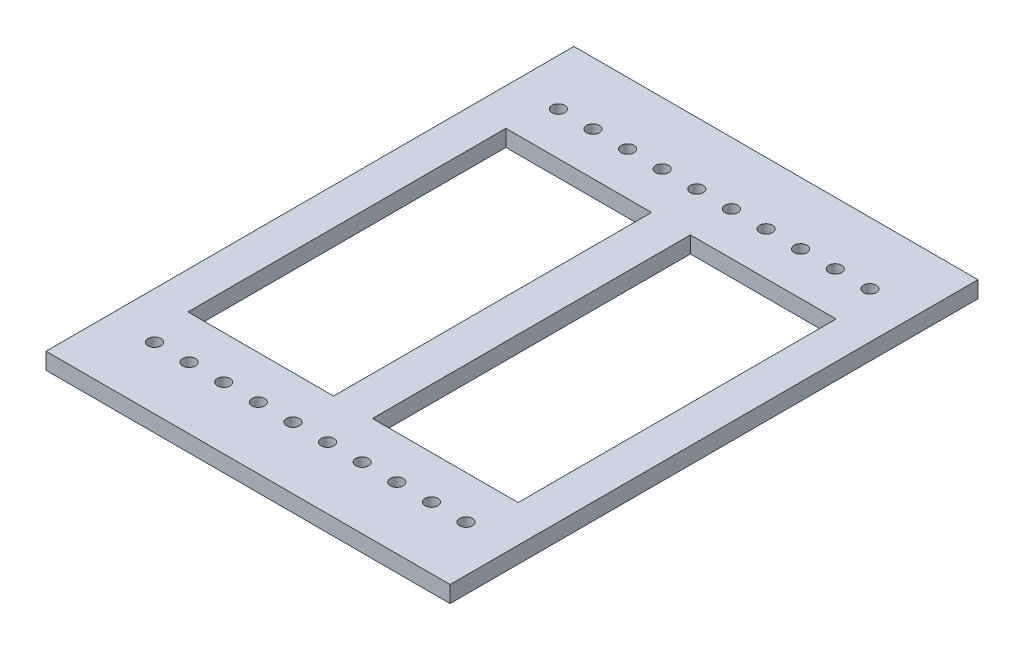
ISO-10303-21;
HEADER;
FILE_DESCRIPTION(('STEP AP214'),'2;1');
FILE_NAME('part.step','',(''),(''),'','','');
FILE_SCHEMA(('AUTOMOTIVE_DESIGN { 1 0 10303 214 1 1 1 1 }'));
ENDSEC;
DATA;
#1=APPLICATION_CONTEXT('core data for automotive mechanical design processes');
#2=APPLICATION_PROTOCOL_DEFINITION('international standard','automotive_design',2000,#1);
#3=PRODUCT_CONTEXT('',#1,'mechanical');
#4=PRODUCT('Part','Part','',(#3));
#5=PRODUCT_RELATED_PRODUCT_CATEGORY('part','',(#4));
#6=PRODUCT_DEFINITION_FORMATION('','',#4);
#7=PRODUCT_DEFINITION_CONTEXT('part definition',#1,'design');
#8=PRODUCT_DEFINITION('design','',#6,#7);
#9=PRODUCT_DEFINITION_SHAPE('','',#8);
#10=(LENGTH_UNIT() NAMED_UNIT(*) SI_UNIT(.MILLI.,.METRE.));
#11=(NAMED_UNIT(*) PLANE_ANGLE_UNIT() SI_UNIT($,.RADIAN.));
#12=(NAMED_UNIT(*) SI_UNIT($,.STERADIAN.) SOLID_ANGLE_UNIT());
#13=UNCERTAINTY_MEASURE_WITH_UNIT(LENGTH_MEASURE(1.E-05),#10,'distance_accuracy_value','');
#14=(GEOMETRIC_REPRESENTATION_CONTEXT(3) GLOBAL_UNCERTAINTY_ASSIGNED_CONTEXT((#13)) GLOBAL_UNIT_ASSIGNED_CONTEXT((#10,
#11,#12)) REPRESENTATION_CONTEXT('',''));
#15=CARTESIAN_POINT('',(0.,0.,0.));
#16=DIRECTION('',(0.,0.,1.));
#17=DIRECTION('',(1.,0.,0.));
#18=AXIS2_PLACEMENT_3D('',#15,#16,#17);
#19=CARTESIAN_POINT('',(0.,0.85,0.));
#20=DIRECTION('',(0.,-1.,0.));
#21=DIRECTION('',(0.,0.,-1.));
#22=AXIS2_PLACEMENT_3D('',#19,#20,#21);
#23=PLANE('',#22);
#24=DIRECTION('',(0.,0.,1.));
#25=VECTOR('',#24,1.);
#26=CARTESIAN_POINT('',(1.9,0.85,-21.75));
#27=LINE('',#26,#25);
#28=CARTESIAN_POINT('',(1.9,0.85,-21.75));
#29=VERTEX_POINT('',#28);
#30=CARTESIAN_POINT('',(1.9,0.85,-5.4));
#31=VERTEX_POINT('',#30);
#32=EDGE_CURVE('E161',#29,#31,#27,.T.);
#33=ORIENTED_EDGE('',*,*,#32,.F.);
#34=DIRECTION('',(-1.,0.,0.));
#35=VECTOR('',#34,1.);
#36=CARTESIAN_POINT('',(1.9,0.85,-21.75));
#37=LINE('',#36,#35);
#38=CARTESIAN_POINT('',(9.39,0.85,-21.75));
#39=VERTEX_POINT('',#38);
#40=EDGE_CURVE('E169',#39,#29,#37,.T.);
#41=ORIENTED_EDGE('',*,*,#40,.F.);
#42=DIRECTION('',(0.,0.,-1.));
#43=VECTOR('',#42,1.);
#44=CARTESIAN_POINT('',(9.39,0.85,-21.75));
#45=LINE('',#44,#43);
#46=CARTESIAN_POINT('',(9.39,0.85,-5.4));
#47=VERTEX_POINT('',#46);
#48=EDGE_CURVE('E166',#47,#39,#45,.T.);
#49=ORIENTED_EDGE('',*,*,#48,.F.);
#50=DIRECTION('',(1.,0.,0.));
#51=VECTOR('',#50,1.);
#52=CARTESIAN_POINT('',(1.9,0.85,-5.4));
#53=LINE('',#52,#51);
#54=EDGE_CURVE('E163',#31,#47,#53,.T.);
#55=ORIENTED_EDGE('',*,*,#54,.F.);
#56=EDGE_LOOP('',(#33,#41,#49,#55));
#57=FACE_BOUND('',#56,.T.);
#58=DIRECTION('',(0.,0.,1.));
#59=VECTOR('',#58,1.);
#60=CARTESIAN_POINT('',(0.,0.85,0.));
#61=LINE('',#60,#59);
#62=CARTESIAN_POINT('',(0.,0.85,-27.15));
#63=VERTEX_POINT('',#62);
#64=CARTESIAN_POINT('',(0.,0.85,0.));
#65=VERTEX_POINT('',#64);
#66=EDGE_CURVE('E192',#63,#65,#61,.T.);
#67=ORIENTED_EDGE('',*,*,#66,.T.);
#68=DIRECTION('',(1.,0.,0.));
#69=VECTOR('',#68,1.);
#70=CARTESIAN_POINT('',(0.,0.85,0.));
#71=LINE('',#70,#69);
#72=CARTESIAN_POINT('',(20.78,0.85,0.));
#73=VERTEX_POINT('',#72);
#74=EDGE_CURVE('E195',#65,#73,#71,.T.);
#75=ORIENTED_EDGE('',*,*,#74,.T.);
#76=DIRECTION('',(0.,0.,-1.));
#77=VECTOR('',#76,1.);
#78=CARTESIAN_POINT('',(20.78,0.85,0.));
#79=LINE('',#78,#77);
#80=CARTESIAN_POINT('',(20.78,0.85,-27.15));
#81=VERTEX_POINT('',#80);
#82=EDGE_CURVE('E198',#73,#81,#79,.T.);
#83=ORIENTED_EDGE('',*,*,#82,.T.);
#84=DIRECTION('',(-1.,0.,0.));
#85=VECTOR('',#84,1.);
#86=CARTESIAN_POINT('',(0.,0.85,-27.15));
#87=LINE('',#86,#85);
#88=EDGE_CURVE('E200',#81,#63,#87,.T.);
#89=ORIENTED_EDGE('',*,*,#88,.T.);
#90=EDGE_LOOP('',(#67,#75,#83,#89));
#91=FACE_BOUND('',#90,.T.);
#92=DIRECTION('',(0.,0.,-1.));
#93=VECTOR('',#92,1.);
#94=CARTESIAN_POINT('',(18.88,0.85,-21.75));
#95=LINE('',#94,#93);
#96=CARTESIAN_POINT('',(18.88,0.85,-5.40000000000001));
#97=VERTEX_POINT('',#96);
#98=CARTESIAN_POINT('',(18.88,0.85,-21.75));
#99=VERTEX_POINT('',#98);
#100=EDGE_CURVE('E122',#97,#99,#95,.T.);
#101=ORIENTED_EDGE('',*,*,#100,.F.);
#102=DIRECTION('',(1.,0.,0.));
#103=VECTOR('',#102,1.);
#104=CARTESIAN_POINT('',(18.88,0.85,-5.40000000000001));
#105=LINE('',#104,#103);
#106=CARTESIAN_POINT('',(11.39,0.85,-5.40000000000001));
#107=VERTEX_POINT('',#106);
#108=EDGE_CURVE('E145',#107,#97,#105,.T.);
#109=ORIENTED_EDGE('',*,*,#108,.F.);
#110=DIRECTION('',(0.,0.,1.));
#111=VECTOR('',#110,1.);
#112=CARTESIAN_POINT('',(11.39,0.85,-21.75));
#113=LINE('',#112,#111);
#114=CARTESIAN_POINT('',(11.39,0.85,-21.75));
#115=VERTEX_POINT('',#114);
#116=EDGE_CURVE('E143',#115,#107,#113,.T.);
#117=ORIENTED_EDGE('',*,*,#116,.F.);
#118=DIRECTION('',(-1.,0.,0.));
#119=VECTOR('',#118,1.);
#120=CARTESIAN_POINT('',(18.88,0.85,-21.75));
#121=LINE('',#120,#119);
#122=EDGE_CURVE('E130',#99,#115,#121,.T.);
#123=ORIENTED_EDGE('',*,*,#122,.F.);
#124=EDGE_LOOP('',(#101,#109,#117,#123));
#125=FACE_BOUND('',#124,.T.);
#126=CARTESIAN_POINT('',(2.389,0.85,-23.96));
#127=DIRECTION('',(0.,1.,0.));
#128=DIRECTION('',(0.,0.,1.));
#129=AXIS2_PLACEMENT_3D('',#126,#127,#128);
#130=CIRCLE('',#129,0.33);
#131=CARTESIAN_POINT('',(2.389,0.85,-23.63));
#132=VERTEX_POINT('',#131);
#133=EDGE_CURVE('E151',#132,#132,#130,.T.);
#134=ORIENTED_EDGE('',*,*,#133,.F.);
#135=EDGE_LOOP('',(#134));
#136=FACE_BOUND('',#135,.T.);
#137=CARTESIAN_POINT('',(18.409,0.85,-3.19));
#138=DIRECTION('',(0.,1.,0.));
#139=DIRECTION('',(0.,0.,-1.));
#140=AXIS2_PLACEMENT_3D('',#137,#138,#139);
#141=CIRCLE('',#140,0.330000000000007);
#142=CARTESIAN_POINT('',(18.409,0.85,-3.52));
#143=VERTEX_POINT('',#142);
#144=EDGE_CURVE('E491',#143,#143,#141,.T.);
#145=ORIENTED_EDGE('',*,*,#144,.F.);
#146=EDGE_LOOP('',(#145));
#147=FACE_BOUND('',#146,.T.);
#148=CARTESIAN_POINT('',(4.169,0.85,-23.96));
#149=DIRECTION('',(0.,1.,0.));
#150=DIRECTION('',(0.,0.,1.));
#151=AXIS2_PLACEMENT_3D('',#148,#149,#150);
#152=CIRCLE('',#151,0.33);
#153=CARTESIAN_POINT('',(4.169,0.85,-23.63));
#154=VERTEX_POINT('',#153);
#155=EDGE_CURVE('E485',#154,#154,#152,.T.);
#156=ORIENTED_EDGE('',*,*,#155,.F.);
#157=EDGE_LOOP('',(#156));
#158=FACE_BOUND('',#157,.T.);
#159=CARTESIAN_POINT('',(5.949,0.85,-23.96));
#160=DIRECTION('',(0.,1.,0.));
#161=DIRECTION('',(0.,0.,1.));
#162=AXIS2_PLACEMENT_3D('',#159,#160,#161);
#163=CIRCLE('',#162,0.33);
#164=CARTESIAN_POINT('',(5.949,0.85,-23.63));
#165=VERTEX_POINT('',#164);
#166=EDGE_CURVE('E479',#165,#165,#163,.T.);
#167=ORIENTED_EDGE('',*,*,#166,.F.);
#168=EDGE_LOOP('',(#167));
#169=FACE_BOUND('',#168,.T.);
#170=CARTESIAN_POINT('',(7.729,0.85,-23.96));
#171=DIRECTION('',(0.,1.,0.));
#172=DIRECTION('',(0.,0.,1.));
#173=AXIS2_PLACEMENT_3D('',#170,#171,#172);
#174=CIRCLE('',#173,0.33);
#175=CARTESIAN_POINT('',(7.729,0.85,-23.63));
#176=VERTEX_POINT('',#175);
#177=EDGE_CURVE('E473',#176,#176,#174,.T.);
#178=ORIENTED_EDGE('',*,*,#177,.F.);
#179=EDGE_LOOP('',(#178));
#180=FACE_BOUND('',#179,.T.);
#181=CARTESIAN_POINT('',(9.509,0.85,-23.96));
#182=DIRECTION('',(0.,1.,0.));
#183=DIRECTION('',(0.,0.,1.));
#184=AXIS2_PLACEMENT_3D('',#181,#182,#183);
#185=CIRCLE('',#184,0.33);
#186=CARTESIAN_POINT('',(9.509,0.85,-23.63));
#187=VERTEX_POINT('',#186);
#188=EDGE_CURVE('E467',#187,#187,#185,.T.);
#189=ORIENTED_EDGE('',*,*,#188,.F.);
#190=EDGE_LOOP('',(#189));
#191=FACE_BOUND('',#190,.T.);
#192=CARTESIAN_POINT('',(11.289,0.85,-23.96));
#193=DIRECTION('',(0.,1.,0.));
#194=DIRECTION('',(0.,0.,1.));
#195=AXIS2_PLACEMENT_3D('',#192,#193,#194);
#196=CIRCLE('',#195,0.329999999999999);
#197=CARTESIAN_POINT('',(11.289,0.85,-23.63));
#198=VERTEX_POINT('',#197);
#199=EDGE_CURVE('E461',#198,#198,#196,.T.);
#200=ORIENTED_EDGE('',*,*,#199,.F.);
#201=EDGE_LOOP('',(#200));
#202=FACE_BOUND('',#201,.T.);
#203=CARTESIAN_POINT('',(13.069,0.85,-23.96));
#204=DIRECTION('',(0.,1.,0.));
#205=DIRECTION('',(0.,0.,1.));
#206=AXIS2_PLACEMENT_3D('',#203,#204,#205);
#207=CIRCLE('',#206,0.329999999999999);
#208=CARTESIAN_POINT('',(13.069,0.85,-23.63));
#209=VERTEX_POINT('',#208);
#210=EDGE_CURVE('E455',#209,#209,#207,.T.);
#211=ORIENTED_EDGE('',*,*,#210,.F.);
#212=EDGE_LOOP('',(#211));
#213=FACE_BOUND('',#212,.T.);
#214=CARTESIAN_POINT('',(14.849,0.85,-23.96));
#215=DIRECTION('',(0.,1.,0.));
#216=DIRECTION('',(0.,0.,1.));
#217=AXIS2_PLACEMENT_3D('',#214,#215,#216);
#218=CIRCLE('',#217,0.329999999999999);
#219=CARTESIAN_POINT('',(14.849,0.85,-23.63));
#220=VERTEX_POINT('',#219);
#221=EDGE_CURVE('E449',#220,#220,#218,.T.);
#222=ORIENTED_EDGE('',*,*,#221,.F.);
#223=EDGE_LOOP('',(#222));
#224=FACE_BOUND('',#223,.T.);
#225=CARTESIAN_POINT('',(16.629,0.85,-23.96));
#226=DIRECTION('',(0.,1.,0.));
#227=DIRECTION('',(0.,0.,1.));
#228=AXIS2_PLACEMENT_3D('',#225,#226,#227);
#229=CIRCLE('',#228,0.33);
#230=CARTESIAN_POINT('',(16.629,0.85,-23.63));
#231=VERTEX_POINT('',#230);
#232=EDGE_CURVE('E443',#231,#231,#229,.T.);
#233=ORIENTED_EDGE('',*,*,#232,.F.);
#234=EDGE_LOOP('',(#233));
#235=FACE_BOUND('',#234,.T.);
#236=CARTESIAN_POINT('',(18.409,0.85,-23.96));
#237=DIRECTION('',(0.,1.,0.));
#238=DIRECTION('',(0.,0.,1.));
#239=AXIS2_PLACEMENT_3D('',#236,#237,#238);
#240=CIRCLE('',#239,0.33);
#241=CARTESIAN_POINT('',(18.409,0.85,-23.63));
#242=VERTEX_POINT('',#241);
#243=EDGE_CURVE('E437',#242,#242,#240,.T.);
#244=ORIENTED_EDGE('',*,*,#243,.F.);
#245=EDGE_LOOP('',(#244));
#246=FACE_BOUND('',#245,.T.);
#247=CARTESIAN_POINT('',(16.629,0.85,-3.19));
#248=DIRECTION('',(0.,1.,0.));
#249=DIRECTION('',(0.,0.,-1.));
#250=AXIS2_PLACEMENT_3D('',#247,#248,#249);
#251=CIRCLE('',#250,0.330000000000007);
#252=CARTESIAN_POINT('',(16.629,0.85,-3.52));
#253=VERTEX_POINT('',#252);
#254=EDGE_CURVE('E431',#253,#253,#251,.T.);
#255=ORIENTED_EDGE('',*,*,#254,.F.);
#256=EDGE_LOOP('',(#255));
#257=FACE_BOUND('',#256,.T.);
#258=CARTESIAN_POINT('',(14.849,0.85,-3.18999999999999));
#259=DIRECTION('',(0.,1.,0.));
#260=DIRECTION('',(0.,0.,-1.));
#261=AXIS2_PLACEMENT_3D('',#258,#259,#260);
#262=CIRCLE('',#261,0.329999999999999);
#263=CARTESIAN_POINT('',(14.849,0.85,-3.51999999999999));
#264=VERTEX_POINT('',#263);
#265=EDGE_CURVE('E425',#264,#264,#262,.T.);
#266=ORIENTED_EDGE('',*,*,#265,.F.);
#267=EDGE_LOOP('',(#266));
#268=FACE_BOUND('',#267,.T.);
#269=CARTESIAN_POINT('',(13.069,0.85,-3.18999999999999));
#270=DIRECTION('',(0.,1.,0.));
#271=DIRECTION('',(0.,0.,-1.));
#272=AXIS2_PLACEMENT_3D('',#269,#270,#271);
#273=CIRCLE('',#272,0.329999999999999);
#274=CARTESIAN_POINT('',(13.069,0.85,-3.51999999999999));
#275=VERTEX_POINT('',#274);
#276=EDGE_CURVE('E419',#275,#275,#273,.T.);
#277=ORIENTED_EDGE('',*,*,#276,.F.);
#278=EDGE_LOOP('',(#277));
#279=FACE_BOUND('',#278,.T.);
#280=CARTESIAN_POINT('',(11.289,0.85,-3.18999999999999));
#281=DIRECTION('',(0.,1.,0.));
#282=DIRECTION('',(0.,0.,-1.));
#283=AXIS2_PLACEMENT_3D('',#280,#281,#282);
#284=CIRCLE('',#283,0.329999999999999);
#285=CARTESIAN_POINT('',(11.289,0.85,-3.51999999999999));
#286=VERTEX_POINT('',#285);
#287=EDGE_CURVE('E413',#286,#286,#284,.T.);
#288=ORIENTED_EDGE('',*,*,#287,.F.);
#289=EDGE_LOOP('',(#288));
#290=FACE_BOUND('',#289,.T.);
#291=CARTESIAN_POINT('',(9.509,0.85,-3.18999999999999));
#292=DIRECTION('',(0.,1.,0.));
#293=DIRECTION('',(0.,0.,-1.));
#294=AXIS2_PLACEMENT_3D('',#291,#292,#293);
#295=CIRCLE('',#294,0.33);
#296=CARTESIAN_POINT('',(9.509,0.85,-3.51999999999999));
#297=VERTEX_POINT('',#296);
#298=EDGE_CURVE('E407',#297,#297,#295,.T.);
#299=ORIENTED_EDGE('',*,*,#298,.F.);
#300=EDGE_LOOP('',(#299));
#301=FACE_BOUND('',#300,.T.);
#302=CARTESIAN_POINT('',(7.729,0.85,-3.18999999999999));
#303=DIRECTION('',(0.,1.,0.));
#304=DIRECTION('',(0.,0.,-1.));
#305=AXIS2_PLACEMENT_3D('',#302,#303,#304);
#306=CIRCLE('',#305,0.33);
#307=CARTESIAN_POINT('',(7.729,0.85,-3.51999999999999));
#308=VERTEX_POINT('',#307);
#309=EDGE_CURVE('E401',#308,#308,#306,.T.);
#310=ORIENTED_EDGE('',*,*,#309,.F.);
#311=EDGE_LOOP('',(#310));
#312=FACE_BOUND('',#311,.T.);
#313=CARTESIAN_POINT('',(5.949,0.85,-3.18999999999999));
#314=DIRECTION('',(0.,1.,0.));
#315=DIRECTION('',(0.,0.,-1.));
#316=AXIS2_PLACEMENT_3D('',#313,#314,#315);
#317=CIRCLE('',#316,0.33);
#318=CARTESIAN_POINT('',(5.949,0.85,-3.51999999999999));
#319=VERTEX_POINT('',#318);
#320=EDGE_CURVE('E395',#319,#319,#317,.T.);
#321=ORIENTED_EDGE('',*,*,#320,.F.);
#322=EDGE_LOOP('',(#321));
#323=FACE_BOUND('',#322,.T.);
#324=CARTESIAN_POINT('',(4.169,0.85,-3.18999999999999));
#325=DIRECTION('',(0.,1.,0.));
#326=DIRECTION('',(0.,0.,-1.));
#327=AXIS2_PLACEMENT_3D('',#324,#325,#326);
#328=CIRCLE('',#327,0.33);
#329=CARTESIAN_POINT('',(4.169,0.85,-3.51999999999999));
#330=VERTEX_POINT('',#329);
#331=EDGE_CURVE('E389',#330,#330,#328,.T.);
#332=ORIENTED_EDGE('',*,*,#331,.F.);
#333=EDGE_LOOP('',(#332));
#334=FACE_BOUND('',#333,.T.);
#335=CARTESIAN_POINT('',(2.389,0.85,-3.18999999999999));
#336=DIRECTION('',(0.,1.,0.));
#337=DIRECTION('',(0.,0.,-1.));
#338=AXIS2_PLACEMENT_3D('',#335,#336,#337);
#339=CIRCLE('',#338,0.33);
#340=CARTESIAN_POINT('',(2.389,0.85,-3.51999999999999));
#341=VERTEX_POINT('',#340);
#342=EDGE_CURVE('E380',#341,#341,#339,.T.);
#343=ORIENTED_EDGE('',*,*,#342,.F.);
#344=EDGE_LOOP('',(#343));
#345=FACE_BOUND('',#344,.T.);
#346=ADVANCED_FACE('F33',(#57,#91,#125,#136,#147,#158,#169,#180,#191,#202,#213,#224,#235,#246,
#257,#268,#279,#290,#301,#312,#323,#334,#345),#23,.F.);
#347=CARTESIAN_POINT('',(0.,0.,0.));
#348=DIRECTION('',(0.,-1.,0.));
#349=DIRECTION('',(0.,0.,-1.));
#350=AXIS2_PLACEMENT_3D('',#347,#348,#349);
#351=PLANE('',#350);
#352=CARTESIAN_POINT('',(4.169,0.,-3.18999999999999));
#353=DIRECTION('',(0.,1.,0.));
#354=DIRECTION('',(0.,0.,-1.));
#355=AXIS2_PLACEMENT_3D('',#352,#353,#354);
#356=CIRCLE('',#355,0.33);
#357=CARTESIAN_POINT('',(4.169,0.,-3.51999999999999));
#358=VERTEX_POINT('',#357);
#359=EDGE_CURVE('E386',#358,#358,#356,.T.);
#360=ORIENTED_EDGE('',*,*,#359,.T.);
#361=EDGE_LOOP('',(#360));
#362=FACE_BOUND('',#361,.T.);
#363=CARTESIAN_POINT('',(7.729,0.,-3.18999999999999));
#364=DIRECTION('',(0.,1.,0.));
#365=DIRECTION('',(0.,0.,-1.));
#366=AXIS2_PLACEMENT_3D('',#363,#364,#365);
#367=CIRCLE('',#366,0.33);
#368=CARTESIAN_POINT('',(7.729,0.,-3.51999999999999));
#369=VERTEX_POINT('',#368);
#370=EDGE_CURVE('E398',#369,#369,#367,.T.);
#371=ORIENTED_EDGE('',*,*,#370,.T.);
#372=EDGE_LOOP('',(#371));
#373=FACE_BOUND('',#372,.T.);
#374=CARTESIAN_POINT('',(11.289,0.,-3.18999999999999));
#375=DIRECTION('',(0.,1.,0.));
#376=DIRECTION('',(0.,0.,-1.));
#377=AXIS2_PLACEMENT_3D('',#374,#375,#376);
#378=CIRCLE('',#377,0.329999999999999);
#379=CARTESIAN_POINT('',(11.289,0.,-3.51999999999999));
#380=VERTEX_POINT('',#379);
#381=EDGE_CURVE('E410',#380,#380,#378,.T.);
#382=ORIENTED_EDGE('',*,*,#381,.T.);
#383=EDGE_LOOP('',(#382));
#384=FACE_BOUND('',#383,.T.);
#385=CARTESIAN_POINT('',(14.849,0.,-3.18999999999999));
#386=DIRECTION('',(0.,1.,0.));
#387=DIRECTION('',(0.,0.,-1.));
#388=AXIS2_PLACEMENT_3D('',#385,#386,#387);
#389=CIRCLE('',#388,0.329999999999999);
#390=CARTESIAN_POINT('',(14.849,0.,-3.51999999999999));
#391=VERTEX_POINT('',#390);
#392=EDGE_CURVE('E422',#391,#391,#389,.T.);
#393=ORIENTED_EDGE('',*,*,#392,.T.);
#394=EDGE_LOOP('',(#393));
#395=FACE_BOUND('',#394,.T.);
#396=CARTESIAN_POINT('',(18.409,0.,-23.96));
#397=DIRECTION('',(0.,1.,0.));
#398=DIRECTION('',(0.,0.,1.));
#399=AXIS2_PLACEMENT_3D('',#396,#397,#398);
#400=CIRCLE('',#399,0.33);
#401=CARTESIAN_POINT('',(18.409,0.,-23.63));
#402=VERTEX_POINT('',#401);
#403=EDGE_CURVE('E434',#402,#402,#400,.T.);
#404=ORIENTED_EDGE('',*,*,#403,.T.);
#405=EDGE_LOOP('',(#404));
#406=FACE_BOUND('',#405,.T.);
#407=CARTESIAN_POINT('',(14.849,0.,-23.96));
#408=DIRECTION('',(0.,1.,0.));
#409=DIRECTION('',(0.,0.,1.));
#410=AXIS2_PLACEMENT_3D('',#407,#408,#409);
#411=CIRCLE('',#410,0.329999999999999);
#412=CARTESIAN_POINT('',(14.849,0.,-23.63));
#413=VERTEX_POINT('',#412);
#414=EDGE_CURVE('E446',#413,#413,#411,.T.);
#415=ORIENTED_EDGE('',*,*,#414,.T.);
#416=EDGE_LOOP('',(#415));
#417=FACE_BOUND('',#416,.T.);
#418=CARTESIAN_POINT('',(11.289,0.,-23.96));
#419=DIRECTION('',(0.,1.,0.));
#420=DIRECTION('',(0.,0.,1.));
#421=AXIS2_PLACEMENT_3D('',#418,#419,#420);
#422=CIRCLE('',#421,0.329999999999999);
#423=CARTESIAN_POINT('',(11.289,0.,-23.63));
#424=VERTEX_POINT('',#423);
#425=EDGE_CURVE('E458',#424,#424,#422,.T.);
#426=ORIENTED_EDGE('',*,*,#425,.T.);
#427=EDGE_LOOP('',(#426));
#428=FACE_BOUND('',#427,.T.);
#429=CARTESIAN_POINT('',(7.729,0.,-23.96));
#430=DIRECTION('',(0.,1.,0.));
#431=DIRECTION('',(0.,0.,1.));
#432=AXIS2_PLACEMENT_3D('',#429,#430,#431);
#433=CIRCLE('',#432,0.33);
#434=CARTESIAN_POINT('',(7.729,0.,-23.63));
#435=VERTEX_POINT('',#434);
#436=EDGE_CURVE('E470',#435,#435,#433,.T.);
#437=ORIENTED_EDGE('',*,*,#436,.T.);
#438=EDGE_LOOP('',(#437));
#439=FACE_BOUND('',#438,.T.);
#440=CARTESIAN_POINT('',(4.169,0.,-23.96));
#441=DIRECTION('',(0.,1.,0.));
#442=DIRECTION('',(0.,0.,1.));
#443=AXIS2_PLACEMENT_3D('',#440,#441,#442);
#444=CIRCLE('',#443,0.33);
#445=CARTESIAN_POINT('',(4.169,0.,-23.63));
#446=VERTEX_POINT('',#445);
#447=EDGE_CURVE('E482',#446,#446,#444,.T.);
#448=ORIENTED_EDGE('',*,*,#447,.T.);
#449=EDGE_LOOP('',(#448));
#450=FACE_BOUND('',#449,.T.);
#451=CARTESIAN_POINT('',(2.389,0.,-23.96));
#452=DIRECTION('',(0.,1.,0.));
#453=DIRECTION('',(0.,0.,1.));
#454=AXIS2_PLACEMENT_3D('',#451,#452,#453);
#455=CIRCLE('',#454,0.33);
#456=CARTESIAN_POINT('',(2.389,0.,-23.63));
#457=VERTEX_POINT('',#456);
#458=EDGE_CURVE('E494',#457,#457,#455,.T.);
#459=ORIENTED_EDGE('',*,*,#458,.T.);
#460=EDGE_LOOP('',(#459));
#461=FACE_BOUND('',#460,.T.);
#462=DIRECTION('',(0.,0.,1.));
#463=VECTOR('',#462,1.);
#464=CARTESIAN_POINT('',(0.,0.,0.));
#465=LINE('',#464,#463);
#466=CARTESIAN_POINT('',(0.,0.,-27.15));
#467=VERTEX_POINT('',#466);
#468=CARTESIAN_POINT('',(0.,0.,0.));
#469=VERTEX_POINT('',#468);
#470=EDGE_CURVE('E191',#467,#469,#465,.T.);
#471=ORIENTED_EDGE('',*,*,#470,.F.);
#472=DIRECTION('',(-1.,0.,0.));
#473=VECTOR('',#472,1.);
#474=CARTESIAN_POINT('',(0.,0.,-27.15));
#475=LINE('',#474,#473);
#476=CARTESIAN_POINT('',(20.78,0.,-27.15));
#477=VERTEX_POINT('',#476);
#478=EDGE_CURVE('E196',#477,#467,#475,.T.);
#479=ORIENTED_EDGE('',*,*,#478,.F.);
#480=DIRECTION('',(0.,0.,-1.));
#481=VECTOR('',#480,1.);
#482=CARTESIAN_POINT('',(20.78,0.,0.));
#483=LINE('',#482,#481);
#484=CARTESIAN_POINT('',(20.78,0.,0.));
#485=VERTEX_POINT('',#484);
#486=EDGE_CURVE('E207',#485,#477,#483,.T.);
#487=ORIENTED_EDGE('',*,*,#486,.F.);
#488=DIRECTION('',(1.,0.,0.));
#489=VECTOR('',#488,1.);
#490=CARTESIAN_POINT('',(0.,0.,0.));
#491=LINE('',#490,#489);
#492=EDGE_CURVE('E205',#469,#485,#491,.T.);
#493=ORIENTED_EDGE('',*,*,#492,.F.);
#494=EDGE_LOOP('',(#471,#479,#487,#493));
#495=FACE_BOUND('',#494,.T.);
#496=DIRECTION('',(-1.,0.,0.));
#497=VECTOR('',#496,1.);
#498=CARTESIAN_POINT('',(1.9,0.,-21.75));
#499=LINE('',#498,#497);
#500=CARTESIAN_POINT('',(9.39,0.,-21.75));
#501=VERTEX_POINT('',#500);
#502=CARTESIAN_POINT('',(1.9,0.,-21.75));
#503=VERTEX_POINT('',#502);
#504=EDGE_CURVE('E164',#501,#503,#499,.T.);
#505=ORIENTED_EDGE('',*,*,#504,.T.);
#506=DIRECTION('',(0.,0.,1.));
#507=VECTOR('',#506,1.);
#508=CARTESIAN_POINT('',(1.9,0.,-21.75));
#509=LINE('',#508,#507);
#510=CARTESIAN_POINT('',(1.9,0.,-5.4));
#511=VERTEX_POINT('',#510);
#512=EDGE_CURVE('E138',#503,#511,#509,.T.);
#513=ORIENTED_EDGE('',*,*,#512,.T.);
#514=DIRECTION('',(1.,0.,0.));
#515=VECTOR('',#514,1.);
#516=CARTESIAN_POINT('',(1.9,0.,-5.4));
#517=LINE('',#516,#515);
#518=CARTESIAN_POINT('',(9.39,0.,-5.4));
#519=VERTEX_POINT('',#518);
#520=EDGE_CURVE('E174',#511,#519,#517,.T.);
#521=ORIENTED_EDGE('',*,*,#520,.T.);
#522=DIRECTION('',(0.,0.,-1.));
#523=VECTOR('',#522,1.);
#524=CARTESIAN_POINT('',(9.39,0.,-21.75));
#525=LINE('',#524,#523);
#526=EDGE_CURVE('E177',#519,#501,#525,.T.);
#527=ORIENTED_EDGE('',*,*,#526,.T.);
#528=EDGE_LOOP('',(#505,#513,#521,#527));
#529=FACE_BOUND('',#528,.T.);
#530=DIRECTION('',(1.,0.,0.));
#531=VECTOR('',#530,1.);
#532=CARTESIAN_POINT('',(18.88,0.,-5.40000000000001));
#533=LINE('',#532,#531);
#534=CARTESIAN_POINT('',(11.39,0.,-5.40000000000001));
#535=VERTEX_POINT('',#534);
#536=CARTESIAN_POINT('',(18.88,0.,-5.40000000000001));
#537=VERTEX_POINT('',#536);
#538=EDGE_CURVE('E131',#535,#537,#533,.T.);
#539=ORIENTED_EDGE('',*,*,#538,.T.);
#540=DIRECTION('',(0.,0.,-1.));
#541=VECTOR('',#540,1.);
#542=CARTESIAN_POINT('',(18.88,0.,-21.75));
#543=LINE('',#542,#541);
#544=CARTESIAN_POINT('',(18.88,0.,-21.75));
#545=VERTEX_POINT('',#544);
#546=EDGE_CURVE('E56',#537,#545,#543,.T.);
#547=ORIENTED_EDGE('',*,*,#546,.T.);
#548=DIRECTION('',(-1.,0.,0.));
#549=VECTOR('',#548,1.);
#550=CARTESIAN_POINT('',(18.88,0.,-21.75));
#551=LINE('',#550,#549);
#552=CARTESIAN_POINT('',(11.39,0.,-21.75));
#553=VERTEX_POINT('',#552);
#554=EDGE_CURVE('E137',#545,#553,#551,.T.);
#555=ORIENTED_EDGE('',*,*,#554,.T.);
#556=DIRECTION('',(0.,0.,1.));
#557=VECTOR('',#556,1.);
#558=CARTESIAN_POINT('',(11.39,0.,-21.75));
#559=LINE('',#558,#557);
#560=EDGE_CURVE('E153',#553,#535,#559,.T.);
#561=ORIENTED_EDGE('',*,*,#560,.T.);
#562=EDGE_LOOP('',(#539,#547,#555,#561));
#563=FACE_BOUND('',#562,.T.);
#564=CARTESIAN_POINT('',(18.409,0.,-3.19));
#565=DIRECTION('',(0.,1.,0.));
#566=DIRECTION('',(0.,0.,-1.));
#567=AXIS2_PLACEMENT_3D('',#564,#565,#566);
#568=CIRCLE('',#567,0.330000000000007);
#569=CARTESIAN_POINT('',(18.409,0.,-3.52));
#570=VERTEX_POINT('',#569);
#571=EDGE_CURVE('E488',#570,#570,#568,.T.);
#572=ORIENTED_EDGE('',*,*,#571,.T.);
#573=EDGE_LOOP('',(#572));
#574=FACE_BOUND('',#573,.T.);
#575=CARTESIAN_POINT('',(5.949,0.,-23.96));
#576=DIRECTION('',(0.,1.,0.));
#577=DIRECTION('',(0.,0.,1.));
#578=AXIS2_PLACEMENT_3D('',#575,#576,#577);
#579=CIRCLE('',#578,0.33);
#580=CARTESIAN_POINT('',(5.949,0.,-23.63));
#581=VERTEX_POINT('',#580);
#582=EDGE_CURVE('E476',#581,#581,#579,.T.);
#583=ORIENTED_EDGE('',*,*,#582,.T.);
#584=EDGE_LOOP('',(#583));
#585=FACE_BOUND('',#584,.T.);
#586=CARTESIAN_POINT('',(9.509,0.,-23.96));
#587=DIRECTION('',(0.,1.,0.));
#588=DIRECTION('',(0.,0.,1.));
#589=AXIS2_PLACEMENT_3D('',#586,#587,#588);
#590=CIRCLE('',#589,0.33);
#591=CARTESIAN_POINT('',(9.509,0.,-23.63));
#592=VERTEX_POINT('',#591);
#593=EDGE_CURVE('E464',#592,#592,#590,.T.);
#594=ORIENTED_EDGE('',*,*,#593,.T.);
#595=EDGE_LOOP('',(#594));
#596=FACE_BOUND('',#595,.T.);
#597=CARTESIAN_POINT('',(13.069,0.,-23.96));
#598=DIRECTION('',(0.,1.,0.));
#599=DIRECTION('',(0.,0.,1.));
#600=AXIS2_PLACEMENT_3D('',#597,#598,#599);
#601=CIRCLE('',#600,0.329999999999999);
#602=CARTESIAN_POINT('',(13.069,0.,-23.63));
#603=VERTEX_POINT('',#602);
#604=EDGE_CURVE('E452',#603,#603,#601,.T.);
#605=ORIENTED_EDGE('',*,*,#604,.T.);
#606=EDGE_LOOP('',(#605));
#607=FACE_BOUND('',#606,.T.);
#608=CARTESIAN_POINT('',(16.629,0.,-23.96));
#609=DIRECTION('',(0.,1.,0.));
#610=DIRECTION('',(0.,0.,1.));
#611=AXIS2_PLACEMENT_3D('',#608,#609,#610);
#612=CIRCLE('',#611,0.33);
#613=CARTESIAN_POINT('',(16.629,0.,-23.63));
#614=VERTEX_POINT('',#613);
#615=EDGE_CURVE('E440',#614,#614,#612,.T.);
#616=ORIENTED_EDGE('',*,*,#615,.T.);
#617=EDGE_LOOP('',(#616));
#618=FACE_BOUND('',#617,.T.);
#619=CARTESIAN_POINT('',(16.629,0.,-3.19));
#620=DIRECTION('',(0.,1.,0.));
#621=DIRECTION('',(0.,0.,-1.));
#622=AXIS2_PLACEMENT_3D('',#619,#620,#621);
#623=CIRCLE('',#622,0.330000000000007);
#624=CARTESIAN_POINT('',(16.629,0.,-3.52));
#625=VERTEX_POINT('',#624);
#626=EDGE_CURVE('E428',#625,#625,#623,.T.);
#627=ORIENTED_EDGE('',*,*,#626,.T.);
#628=EDGE_LOOP('',(#627));
#629=FACE_BOUND('',#628,.T.);
#630=CARTESIAN_POINT('',(13.069,0.,-3.18999999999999));
#631=DIRECTION('',(0.,1.,0.));
#632=DIRECTION('',(0.,0.,-1.));
#633=AXIS2_PLACEMENT_3D('',#630,#631,#632);
#634=CIRCLE('',#633,0.329999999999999);
#635=CARTESIAN_POINT('',(13.069,0.,-3.51999999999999));
#636=VERTEX_POINT('',#635);
#637=EDGE_CURVE('E416',#636,#636,#634,.T.);
#638=ORIENTED_EDGE('',*,*,#637,.T.);
#639=EDGE_LOOP('',(#638));
#640=FACE_BOUND('',#639,.T.);
#641=CARTESIAN_POINT('',(9.509,0.,-3.18999999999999));
#642=DIRECTION('',(0.,1.,0.));
#643=DIRECTION('',(0.,0.,-1.));
#644=AXIS2_PLACEMENT_3D('',#641,#642,#643);
#645=CIRCLE('',#644,0.33);
#646=CARTESIAN_POINT('',(9.509,0.,-3.51999999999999));
#647=VERTEX_POINT('',#646);
#648=EDGE_CURVE('E404',#647,#647,#645,.T.);
#649=ORIENTED_EDGE('',*,*,#648,.T.);
#650=EDGE_LOOP('',(#649));
#651=FACE_BOUND('',#650,.T.);
#652=CARTESIAN_POINT('',(5.949,0.,-3.18999999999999));
#653=DIRECTION('',(0.,1.,0.));
#654=DIRECTION('',(0.,0.,-1.));
#655=AXIS2_PLACEMENT_3D('',#652,#653,#654);
#656=CIRCLE('',#655,0.33);
#657=CARTESIAN_POINT('',(5.949,0.,-3.51999999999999));
#658=VERTEX_POINT('',#657);
#659=EDGE_CURVE('E392',#658,#658,#656,.T.);
#660=ORIENTED_EDGE('',*,*,#659,.T.);
#661=EDGE_LOOP('',(#660));
#662=FACE_BOUND('',#661,.T.);
#663=CARTESIAN_POINT('',(2.389,0.,-3.18999999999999));
#664=DIRECTION('',(0.,1.,0.));
#665=DIRECTION('',(0.,0.,-1.));
#666=AXIS2_PLACEMENT_3D('',#663,#664,#665);
#667=CIRCLE('',#666,0.33);
#668=CARTESIAN_POINT('',(2.389,0.,-3.51999999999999));
#669=VERTEX_POINT('',#668);
#670=EDGE_CURVE('E383',#669,#669,#667,.T.);
#671=ORIENTED_EDGE('',*,*,#670,.T.);
#672=EDGE_LOOP('',(#671));
#673=FACE_BOUND('',#672,.T.);
#674=ADVANCED_FACE('F225',(#362,#373,#384,#395,#406,#417,#428,#439,#450,#461,#495,#529,#563,
#574,#585,#596,#607,#618,#629,#640,#651,#662,#673),#351,.T.);
#675=CARTESIAN_POINT('',(0.,0.85,0.));
#676=DIRECTION('',(1.,0.,0.));
#677=DIRECTION('',(0.,0.,-1.));
#678=AXIS2_PLACEMENT_3D('',#675,#676,#677);
#679=PLANE('',#678);
#680=ORIENTED_EDGE('',*,*,#470,.T.);
#681=DIRECTION('',(0.,-1.,0.));
#682=VECTOR('',#681,1.);
#683=CARTESIAN_POINT('',(0.,0.85,0.));
#684=LINE('',#683,#682);
#685=EDGE_CURVE('E11',#65,#469,#684,.T.);
#686=ORIENTED_EDGE('',*,*,#685,.F.);
#687=ORIENTED_EDGE('',*,*,#66,.F.);
#688=DIRECTION('',(0.,-1.,0.));
#689=VECTOR('',#688,1.);
#690=CARTESIAN_POINT('',(0.,0.85,-27.15));
#691=LINE('',#690,#689);
#692=EDGE_CURVE('E202',#63,#467,#691,.T.);
#693=ORIENTED_EDGE('',*,*,#692,.T.);
#694=EDGE_LOOP('',(#680,#686,#687,#693));
#695=FACE_BOUND('',#694,.T.);
#696=ADVANCED_FACE('F35',(#695),#679,.F.);
#697=CARTESIAN_POINT('',(0.,0.85,0.));
#698=DIRECTION('',(0.,0.,-1.));
#699=DIRECTION('',(-1.,0.,0.));
#700=AXIS2_PLACEMENT_3D('',#697,#698,#699);
#701=PLANE('',#700);
#702=ORIENTED_EDGE('',*,*,#492,.T.);
#703=DIRECTION('',(0.,-1.,0.));
#704=VECTOR('',#703,1.);
#705=CARTESIAN_POINT('',(20.78,0.85,0.));
#706=LINE('',#705,#704);
#707=EDGE_CURVE('E41',#73,#485,#706,.T.);
#708=ORIENTED_EDGE('',*,*,#707,.F.);
#709=ORIENTED_EDGE('',*,*,#74,.F.);
#710=ORIENTED_EDGE('',*,*,#685,.T.);
#711=EDGE_LOOP('',(#702,#708,#709,#710));
#712=FACE_BOUND('',#711,.T.);
#713=ADVANCED_FACE('F235',(#712),#701,.F.);
#714=CARTESIAN_POINT('',(20.78,0.85,0.));
#715=DIRECTION('',(-1.,0.,0.));
#716=DIRECTION('',(0.,0.,1.));
#717=AXIS2_PLACEMENT_3D('',#714,#715,#716);
#718=PLANE('',#717);
#719=ORIENTED_EDGE('',*,*,#486,.T.);
#720=DIRECTION('',(0.,-1.,0.));
#721=VECTOR('',#720,1.);
#722=CARTESIAN_POINT('',(20.78,0.85,-27.15));
#723=LINE('',#722,#721);
#724=EDGE_CURVE('E212',#81,#477,#723,.T.);
#725=ORIENTED_EDGE('',*,*,#724,.F.);
#726=ORIENTED_EDGE('',*,*,#82,.F.);
#727=ORIENTED_EDGE('',*,*,#707,.T.);
#728=EDGE_LOOP('',(#719,#725,#726,#727));
#729=FACE_BOUND('',#728,.T.);
#730=ADVANCED_FACE('F219',(#729),#718,.F.);
#731=CARTESIAN_POINT('',(0.,0.85,-27.15));
#732=DIRECTION('',(0.,0.,1.));
#733=DIRECTION('',(1.,0.,0.));
#734=AXIS2_PLACEMENT_3D('',#731,#732,#733);
#735=PLANE('',#734);
#736=ORIENTED_EDGE('',*,*,#478,.T.);
#737=ORIENTED_EDGE('',*,*,#692,.F.);
#738=ORIENTED_EDGE('',*,*,#88,.F.);
#739=ORIENTED_EDGE('',*,*,#724,.T.);
#740=EDGE_LOOP('',(#736,#737,#738,#739));
#741=FACE_BOUND('',#740,.T.);
#742=ADVANCED_FACE('F229',(#741),#735,.F.);
#743=CARTESIAN_POINT('',(1.9,0.85,-21.75));
#744=DIRECTION('',(1.,0.,0.));
#745=DIRECTION('',(0.,0.,-1.));
#746=AXIS2_PLACEMENT_3D('',#743,#744,#745);
#747=PLANE('',#746);
#748=ORIENTED_EDGE('',*,*,#512,.F.);
#749=DIRECTION('',(0.,-1.,0.));
#750=VECTOR('',#749,1.);
#751=CARTESIAN_POINT('',(1.9,0.85,-21.75));
#752=LINE('',#751,#750);
#753=EDGE_CURVE('E171',#29,#503,#752,.T.);
#754=ORIENTED_EDGE('',*,*,#753,.F.);
#755=ORIENTED_EDGE('',*,*,#32,.T.);
#756=DIRECTION('',(0.,-1.,0.));
#757=VECTOR('',#756,1.);
#758=CARTESIAN_POINT('',(1.9,0.85,-5.4));
#759=LINE('',#758,#757);
#760=EDGE_CURVE('E188',#31,#511,#759,.T.);
#761=ORIENTED_EDGE('',*,*,#760,.T.);
#762=EDGE_LOOP('',(#748,#754,#755,#761));
#763=FACE_BOUND('',#762,.T.);
#764=ADVANCED_FACE('F252',(#763),#747,.T.);
#765=CARTESIAN_POINT('',(1.9,0.85,-5.4));
#766=DIRECTION('',(0.,0.,-1.));
#767=DIRECTION('',(-1.,0.,0.));
#768=AXIS2_PLACEMENT_3D('',#765,#766,#767);
#769=PLANE('',#768);
#770=ORIENTED_EDGE('',*,*,#520,.F.);
#771=ORIENTED_EDGE('',*,*,#760,.F.);
#772=ORIENTED_EDGE('',*,*,#54,.T.);
#773=DIRECTION('',(0.,-1.,0.));
#774=VECTOR('',#773,1.);
#775=CARTESIAN_POINT('',(9.39,0.85,-5.4));
#776=LINE('',#775,#774);
#777=EDGE_CURVE('E186',#47,#519,#776,.T.);
#778=ORIENTED_EDGE('',*,*,#777,.T.);
#779=EDGE_LOOP('',(#770,#771,#772,#778));
#780=FACE_BOUND('',#779,.T.);
#781=ADVANCED_FACE('F259',(#780),#769,.T.);
#782=CARTESIAN_POINT('',(9.39,0.85,-21.75));
#783=DIRECTION('',(-1.,0.,0.));
#784=DIRECTION('',(0.,0.,1.));
#785=AXIS2_PLACEMENT_3D('',#782,#783,#784);
#786=PLANE('',#785);
#787=ORIENTED_EDGE('',*,*,#526,.F.);
#788=ORIENTED_EDGE('',*,*,#777,.F.);
#789=ORIENTED_EDGE('',*,*,#48,.T.);
#790=DIRECTION('',(0.,-1.,0.));
#791=VECTOR('',#790,1.);
#792=CARTESIAN_POINT('',(9.39,0.85,-21.75));
#793=LINE('',#792,#791);
#794=EDGE_CURVE('E184',#39,#501,#793,.T.);
#795=ORIENTED_EDGE('',*,*,#794,.T.);
#796=EDGE_LOOP('',(#787,#788,#789,#795));
#797=FACE_BOUND('',#796,.T.);
#798=ADVANCED_FACE('F264',(#797),#786,.T.);
#799=CARTESIAN_POINT('',(1.9,0.85,-21.75));
#800=DIRECTION('',(0.,0.,1.));
#801=DIRECTION('',(1.,0.,0.));
#802=AXIS2_PLACEMENT_3D('',#799,#800,#801);
#803=PLANE('',#802);
#804=ORIENTED_EDGE('',*,*,#504,.F.);
#805=ORIENTED_EDGE('',*,*,#794,.F.);
#806=ORIENTED_EDGE('',*,*,#40,.T.);
#807=ORIENTED_EDGE('',*,*,#753,.T.);
#808=EDGE_LOOP('',(#804,#805,#806,#807));
#809=FACE_BOUND('',#808,.T.);
#810=ADVANCED_FACE('F270',(#809),#803,.T.);
#811=CARTESIAN_POINT('',(18.88,0.85,-21.75));
#812=DIRECTION('',(-1.,0.,0.));
#813=DIRECTION('',(0.,0.,1.));
#814=AXIS2_PLACEMENT_3D('',#811,#812,#813);
#815=PLANE('',#814);
#816=ORIENTED_EDGE('',*,*,#546,.F.);
#817=DIRECTION('',(0.,-1.,0.));
#818=VECTOR('',#817,1.);
#819=CARTESIAN_POINT('',(18.88,0.85,-5.40000000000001));
#820=LINE('',#819,#818);
#821=EDGE_CURVE('E126',#97,#537,#820,.T.);
#822=ORIENTED_EDGE('',*,*,#821,.F.);
#823=ORIENTED_EDGE('',*,*,#100,.T.);
#824=DIRECTION('',(0.,-1.,0.));
#825=VECTOR('',#824,1.);
#826=CARTESIAN_POINT('',(18.88,0.85,-21.75));
#827=LINE('',#826,#825);
#828=EDGE_CURVE('E125',#99,#545,#827,.T.);
#829=ORIENTED_EDGE('',*,*,#828,.T.);
#830=EDGE_LOOP('',(#816,#822,#823,#829));
#831=FACE_BOUND('',#830,.T.);
#832=ADVANCED_FACE('F124',(#831),#815,.T.);
#833=CARTESIAN_POINT('',(18.88,0.85,-21.75));
#834=DIRECTION('',(0.,0.,1.));
#835=DIRECTION('',(1.,0.,0.));
#836=AXIS2_PLACEMENT_3D('',#833,#834,#835);
#837=PLANE('',#836);
#838=ORIENTED_EDGE('',*,*,#554,.F.);
#839=ORIENTED_EDGE('',*,*,#828,.F.);
#840=ORIENTED_EDGE('',*,*,#122,.T.);
#841=DIRECTION('',(0.,-1.,0.));
#842=VECTOR('',#841,1.);
#843=CARTESIAN_POINT('',(11.39,0.85,-21.75));
#844=LINE('',#843,#842);
#845=EDGE_CURVE('E139',#115,#553,#844,.T.);
#846=ORIENTED_EDGE('',*,*,#845,.T.);
#847=EDGE_LOOP('',(#838,#839,#840,#846));
#848=FACE_BOUND('',#847,.T.);
#849=ADVANCED_FACE('F134',(#848),#837,.T.);
#850=CARTESIAN_POINT('',(11.39,0.85,-21.75));
#851=DIRECTION('',(1.,0.,0.));
#852=DIRECTION('',(0.,0.,-1.));
#853=AXIS2_PLACEMENT_3D('',#850,#851,#852);
#854=PLANE('',#853);
#855=ORIENTED_EDGE('',*,*,#560,.F.);
#856=ORIENTED_EDGE('',*,*,#845,.F.);
#857=ORIENTED_EDGE('',*,*,#116,.T.);
#858=DIRECTION('',(0.,-1.,0.));
#859=VECTOR('',#858,1.);
#860=CARTESIAN_POINT('',(11.39,0.85,-5.40000000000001));
#861=LINE('',#860,#859);
#862=EDGE_CURVE('E48',#107,#535,#861,.T.);
#863=ORIENTED_EDGE('',*,*,#862,.T.);
#864=EDGE_LOOP('',(#855,#856,#857,#863));
#865=FACE_BOUND('',#864,.T.);
#866=ADVANCED_FACE('F289',(#865),#854,.T.);
#867=CARTESIAN_POINT('',(18.88,0.85,-5.40000000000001));
#868=DIRECTION('',(0.,0.,-1.));
#869=DIRECTION('',(-1.,0.,0.));
#870=AXIS2_PLACEMENT_3D('',#867,#868,#869);
#871=PLANE('',#870);
#872=ORIENTED_EDGE('',*,*,#538,.F.);
#873=ORIENTED_EDGE('',*,*,#862,.F.);
#874=ORIENTED_EDGE('',*,*,#108,.T.);
#875=ORIENTED_EDGE('',*,*,#821,.T.);
#876=EDGE_LOOP('',(#872,#873,#874,#875));
#877=FACE_BOUND('',#876,.T.);
#878=ADVANCED_FACE('F292',(#877),#871,.T.);
#879=CARTESIAN_POINT('',(2.389,0.85,-23.96));
#880=DIRECTION('',(0.,-1.,0.));
#881=DIRECTION('',(0.,0.,-1.));
#882=AXIS2_PLACEMENT_3D('',#879,#880,#881);
#883=CYLINDRICAL_SURFACE('',#882,0.33);
#884=ORIENTED_EDGE('',*,*,#133,.T.);
#885=EDGE_LOOP('',(#884));
#886=FACE_BOUND('',#885,.T.);
#887=ORIENTED_EDGE('',*,*,#458,.F.);
#888=EDGE_LOOP('',(#887));
#889=FACE_BOUND('',#888,.T.);
#890=ADVANCED_FACE('F296',(#886,#889),#883,.F.);
#891=CARTESIAN_POINT('',(18.409,0.85,-3.19));
#892=DIRECTION('',(0.,-1.,0.));
#893=DIRECTION('',(0.,0.,-1.));
#894=AXIS2_PLACEMENT_3D('',#891,#892,#893);
#895=CYLINDRICAL_SURFACE('',#894,0.330000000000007);
#896=ORIENTED_EDGE('',*,*,#144,.T.);
#897=EDGE_LOOP('',(#896));
#898=FACE_BOUND('',#897,.T.);
#899=ORIENTED_EDGE('',*,*,#571,.F.);
#900=EDGE_LOOP('',(#899));
#901=FACE_BOUND('',#900,.T.);
#902=ADVANCED_FACE('F299',(#898,#901),#895,.F.);
#903=CARTESIAN_POINT('',(4.169,0.85,-23.96));
#904=DIRECTION('',(0.,-1.,0.));
#905=DIRECTION('',(0.,0.,-1.));
#906=AXIS2_PLACEMENT_3D('',#903,#904,#905);
#907=CYLINDRICAL_SURFACE('',#906,0.33);
#908=ORIENTED_EDGE('',*,*,#155,.T.);
#909=EDGE_LOOP('',(#908));
#910=FACE_BOUND('',#909,.T.);
#911=ORIENTED_EDGE('',*,*,#447,.F.);
#912=EDGE_LOOP('',(#911));
#913=FACE_BOUND('',#912,.T.);
#914=ADVANCED_FACE('F303',(#910,#913),#907,.F.);
#915=CARTESIAN_POINT('',(5.949,0.85,-23.96));
#916=DIRECTION('',(0.,-1.,0.));
#917=DIRECTION('',(0.,0.,-1.));
#918=AXIS2_PLACEMENT_3D('',#915,#916,#917);
#919=CYLINDRICAL_SURFACE('',#918,0.33);
#920=ORIENTED_EDGE('',*,*,#166,.T.);
#921=EDGE_LOOP('',(#920));
#922=FACE_BOUND('',#921,.T.);
#923=ORIENTED_EDGE('',*,*,#582,.F.);
#924=EDGE_LOOP('',(#923));
#925=FACE_BOUND('',#924,.T.);
#926=ADVANCED_FACE('F307',(#922,#925),#919,.F.);
#927=CARTESIAN_POINT('',(7.729,0.85,-23.96));
#928=DIRECTION('',(0.,-1.,0.));
#929=DIRECTION('',(0.,0.,-1.));
#930=AXIS2_PLACEMENT_3D('',#927,#928,#929);
#931=CYLINDRICAL_SURFACE('',#930,0.33);
#932=ORIENTED_EDGE('',*,*,#177,.T.);
#933=EDGE_LOOP('',(#932));
#934=FACE_BOUND('',#933,.T.);
#935=ORIENTED_EDGE('',*,*,#436,.F.);
#936=EDGE_LOOP('',(#935));
#937=FACE_BOUND('',#936,.T.);
#938=ADVANCED_FACE('F311',(#934,#937),#931,.F.);
#939=CARTESIAN_POINT('',(9.509,0.85,-23.96));
#940=DIRECTION('',(0.,-1.,0.));
#941=DIRECTION('',(0.,0.,-1.));
#942=AXIS2_PLACEMENT_3D('',#939,#940,#941);
#943=CYLINDRICAL_SURFACE('',#942,0.33);
#944=ORIENTED_EDGE('',*,*,#188,.T.);
#945=EDGE_LOOP('',(#944));
#946=FACE_BOUND('',#945,.T.);
#947=ORIENTED_EDGE('',*,*,#593,.F.);
#948=EDGE_LOOP('',(#947));
#949=FACE_BOUND('',#948,.T.);
#950=ADVANCED_FACE('F315',(#946,#949),#943,.F.);
#951=CARTESIAN_POINT('',(11.289,0.85,-23.96));
#952=DIRECTION('',(0.,-1.,0.));
#953=DIRECTION('',(0.,0.,-1.));
#954=AXIS2_PLACEMENT_3D('',#951,#952,#953);
#955=CYLINDRICAL_SURFACE('',#954,0.329999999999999);
#956=ORIENTED_EDGE('',*,*,#199,.T.);
#957=EDGE_LOOP('',(#956));
#958=FACE_BOUND('',#957,.T.);
#959=ORIENTED_EDGE('',*,*,#425,.F.);
#960=EDGE_LOOP('',(#959));
#961=FACE_BOUND('',#960,.T.);
#962=ADVANCED_FACE('F319',(#958,#961),#955,.F.);
#963=CARTESIAN_POINT('',(13.069,0.85,-23.96));
#964=DIRECTION('',(0.,-1.,0.));
#965=DIRECTION('',(0.,0.,-1.));
#966=AXIS2_PLACEMENT_3D('',#963,#964,#965);
#967=CYLINDRICAL_SURFACE('',#966,0.329999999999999);
#968=ORIENTED_EDGE('',*,*,#210,.T.);
#969=EDGE_LOOP('',(#968));
#970=FACE_BOUND('',#969,.T.);
#971=ORIENTED_EDGE('',*,*,#604,.F.);
#972=EDGE_LOOP('',(#971));
#973=FACE_BOUND('',#972,.T.);
#974=ADVANCED_FACE('F323',(#970,#973),#967,.F.);
#975=CARTESIAN_POINT('',(14.849,0.85,-23.96));
#976=DIRECTION('',(0.,-1.,0.));
#977=DIRECTION('',(0.,0.,-1.));
#978=AXIS2_PLACEMENT_3D('',#975,#976,#977);
#979=CYLINDRICAL_SURFACE('',#978,0.329999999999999);
#980=ORIENTED_EDGE('',*,*,#221,.T.);
#981=EDGE_LOOP('',(#980));
#982=FACE_BOUND('',#981,.T.);
#983=ORIENTED_EDGE('',*,*,#414,.F.);
#984=EDGE_LOOP('',(#983));
#985=FACE_BOUND('',#984,.T.);
#986=ADVANCED_FACE('F327',(#982,#985),#979,.F.);
#987=CARTESIAN_POINT('',(16.629,0.85,-23.96));
#988=DIRECTION('',(0.,-1.,0.));
#989=DIRECTION('',(0.,0.,-1.));
#990=AXIS2_PLACEMENT_3D('',#987,#988,#989);
#991=CYLINDRICAL_SURFACE('',#990,0.33);
#992=ORIENTED_EDGE('',*,*,#232,.T.);
#993=EDGE_LOOP('',(#992));
#994=FACE_BOUND('',#993,.T.);
#995=ORIENTED_EDGE('',*,*,#615,.F.);
#996=EDGE_LOOP('',(#995));
#997=FACE_BOUND('',#996,.T.);
#998=ADVANCED_FACE('F331',(#994,#997),#991,.F.);
#999=CARTESIAN_POINT('',(18.409,0.85,-23.96));
#1000=DIRECTION('',(0.,-1.,0.));
#1001=DIRECTION('',(0.,0.,-1.));
#1002=AXIS2_PLACEMENT_3D('',#999,#1000,#1001);
#1003=CYLINDRICAL_SURFACE('',#1002,0.33);
#1004=ORIENTED_EDGE('',*,*,#243,.T.);
#1005=EDGE_LOOP('',(#1004));
#1006=FACE_BOUND('',#1005,.T.);
#1007=ORIENTED_EDGE('',*,*,#403,.F.);
#1008=EDGE_LOOP('',(#1007));
#1009=FACE_BOUND('',#1008,.T.);
#1010=ADVANCED_FACE('F335',(#1006,#1009),#1003,.F.);
#1011=CARTESIAN_POINT('',(16.629,0.85,-3.19));
#1012=DIRECTION('',(0.,-1.,0.));
#1013=DIRECTION('',(0.,0.,-1.));
#1014=AXIS2_PLACEMENT_3D('',#1011,#1012,#1013);
#1015=CYLINDRICAL_SURFACE('',#1014,0.330000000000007);
#1016=ORIENTED_EDGE('',*,*,#254,.T.);
#1017=EDGE_LOOP('',(#1016));
#1018=FACE_BOUND('',#1017,.T.);
#1019=ORIENTED_EDGE('',*,*,#626,.F.);
#1020=EDGE_LOOP('',(#1019));
#1021=FACE_BOUND('',#1020,.T.);
#1022=ADVANCED_FACE('F339',(#1018,#1021),#1015,.F.);
#1023=CARTESIAN_POINT('',(14.849,0.85,-3.18999999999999));
#1024=DIRECTION('',(0.,-1.,0.));
#1025=DIRECTION('',(0.,0.,-1.));
#1026=AXIS2_PLACEMENT_3D('',#1023,#1024,#1025);
#1027=CYLINDRICAL_SURFACE('',#1026,0.329999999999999);
#1028=ORIENTED_EDGE('',*,*,#265,.T.);
#1029=EDGE_LOOP('',(#1028));
#1030=FACE_BOUND('',#1029,.T.);
#1031=ORIENTED_EDGE('',*,*,#392,.F.);
#1032=EDGE_LOOP('',(#1031));
#1033=FACE_BOUND('',#1032,.T.);
#1034=ADVANCED_FACE('F343',(#1030,#1033),#1027,.F.);
#1035=CARTESIAN_POINT('',(13.069,0.85,-3.18999999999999));
#1036=DIRECTION('',(0.,-1.,0.));
#1037=DIRECTION('',(0.,0.,-1.));
#1038=AXIS2_PLACEMENT_3D('',#1035,#1036,#1037);
#1039=CYLINDRICAL_SURFACE('',#1038,0.329999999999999);
#1040=ORIENTED_EDGE('',*,*,#276,.T.);
#1041=EDGE_LOOP('',(#1040));
#1042=FACE_BOUND('',#1041,.T.);
#1043=ORIENTED_EDGE('',*,*,#637,.F.);
#1044=EDGE_LOOP('',(#1043));
#1045=FACE_BOUND('',#1044,.T.);
#1046=ADVANCED_FACE('F347',(#1042,#1045),#1039,.F.);
#1047=CARTESIAN_POINT('',(11.289,0.85,-3.18999999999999));
#1048=DIRECTION('',(0.,-1.,0.));
#1049=DIRECTION('',(0.,0.,-1.));
#1050=AXIS2_PLACEMENT_3D('',#1047,#1048,#1049);
#1051=CYLINDRICAL_SURFACE('',#1050,0.329999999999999);
#1052=ORIENTED_EDGE('',*,*,#287,.T.);
#1053=EDGE_LOOP('',(#1052));
#1054=FACE_BOUND('',#1053,.T.);
#1055=ORIENTED_EDGE('',*,*,#381,.F.);
#1056=EDGE_LOOP('',(#1055));
#1057=FACE_BOUND('',#1056,.T.);
#1058=ADVANCED_FACE('F351',(#1054,#1057),#1051,.F.);
#1059=CARTESIAN_POINT('',(9.509,0.85,-3.18999999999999));
#1060=DIRECTION('',(0.,-1.,0.));
#1061=DIRECTION('',(0.,0.,-1.));
#1062=AXIS2_PLACEMENT_3D('',#1059,#1060,#1061);
#1063=CYLINDRICAL_SURFACE('',#1062,0.33);
#1064=ORIENTED_EDGE('',*,*,#298,.T.);
#1065=EDGE_LOOP('',(#1064));
#1066=FACE_BOUND('',#1065,.T.);
#1067=ORIENTED_EDGE('',*,*,#648,.F.);
#1068=EDGE_LOOP('',(#1067));
#1069=FACE_BOUND('',#1068,.T.);
#1070=ADVANCED_FACE('F355',(#1066,#1069),#1063,.F.);
#1071=CARTESIAN_POINT('',(7.729,0.85,-3.18999999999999));
#1072=DIRECTION('',(0.,-1.,0.));
#1073=DIRECTION('',(0.,0.,-1.));
#1074=AXIS2_PLACEMENT_3D('',#1071,#1072,#1073);
#1075=CYLINDRICAL_SURFACE('',#1074,0.33);
#1076=ORIENTED_EDGE('',*,*,#309,.T.);
#1077=EDGE_LOOP('',(#1076));
#1078=FACE_BOUND('',#1077,.T.);
#1079=ORIENTED_EDGE('',*,*,#370,.F.);
#1080=EDGE_LOOP('',(#1079));
#1081=FACE_BOUND('',#1080,.T.);
#1082=ADVANCED_FACE('F359',(#1078,#1081),#1075,.F.);
#1083=CARTESIAN_POINT('',(5.949,0.85,-3.18999999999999));
#1084=DIRECTION('',(0.,-1.,0.));
#1085=DIRECTION('',(0.,0.,-1.));
#1086=AXIS2_PLACEMENT_3D('',#1083,#1084,#1085);
#1087=CYLINDRICAL_SURFACE('',#1086,0.33);
#1088=ORIENTED_EDGE('',*,*,#320,.T.);
#1089=EDGE_LOOP('',(#1088));
#1090=FACE_BOUND('',#1089,.T.);
#1091=ORIENTED_EDGE('',*,*,#659,.F.);
#1092=EDGE_LOOP('',(#1091));
#1093=FACE_BOUND('',#1092,.T.);
#1094=ADVANCED_FACE('F363',(#1090,#1093),#1087,.F.);
#1095=CARTESIAN_POINT('',(4.169,0.85,-3.18999999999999));
#1096=DIRECTION('',(0.,-1.,0.));
#1097=DIRECTION('',(0.,0.,-1.));
#1098=AXIS2_PLACEMENT_3D('',#1095,#1096,#1097);
#1099=CYLINDRICAL_SURFACE('',#1098,0.33);
#1100=ORIENTED_EDGE('',*,*,#331,.T.);
#1101=EDGE_LOOP('',(#1100));
#1102=FACE_BOUND('',#1101,.T.);
#1103=ORIENTED_EDGE('',*,*,#359,.F.);
#1104=EDGE_LOOP('',(#1103));
#1105=FACE_BOUND('',#1104,.T.);
#1106=ADVANCED_FACE('F367',(#1102,#1105),#1099,.F.);
#1107=CARTESIAN_POINT('',(2.389,0.85,-3.18999999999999));
#1108=DIRECTION('',(0.,-1.,0.));
#1109=DIRECTION('',(0.,0.,-1.));
#1110=AXIS2_PLACEMENT_3D('',#1107,#1108,#1109);
#1111=CYLINDRICAL_SURFACE('',#1110,0.33);
#1112=ORIENTED_EDGE('',*,*,#342,.T.);
#1113=EDGE_LOOP('',(#1112));
#1114=FACE_BOUND('',#1113,.T.);
#1115=ORIENTED_EDGE('',*,*,#670,.F.);
#1116=EDGE_LOOP('',(#1115));
#1117=FACE_BOUND('',#1116,.T.);
#1118=ADVANCED_FACE('F371',(#1114,#1117),#1111,.F.);
#1119=CLOSED_SHELL('',(#346,#674,#696,#713,#730,#742,#764,#781,#798,#810,#832,#849,#866,#878,
#890,#902,#914,#926,#938,#950,#962,#974,#986,#998,#1010,#1022,#1034,#1046,#1058,#1070,#1082,
#1094,#1106,#1118));
#1120=MANIFOLD_SOLID_BREP('B2',#1119);
#1121=ADVANCED_BREP_SHAPE_REPRESENTATION('',(#18,#1120),#14);
#1122=SHAPE_DEFINITION_REPRESENTATION(#9,#1121);
ENDSEC;
END-ISO-10303-21;
